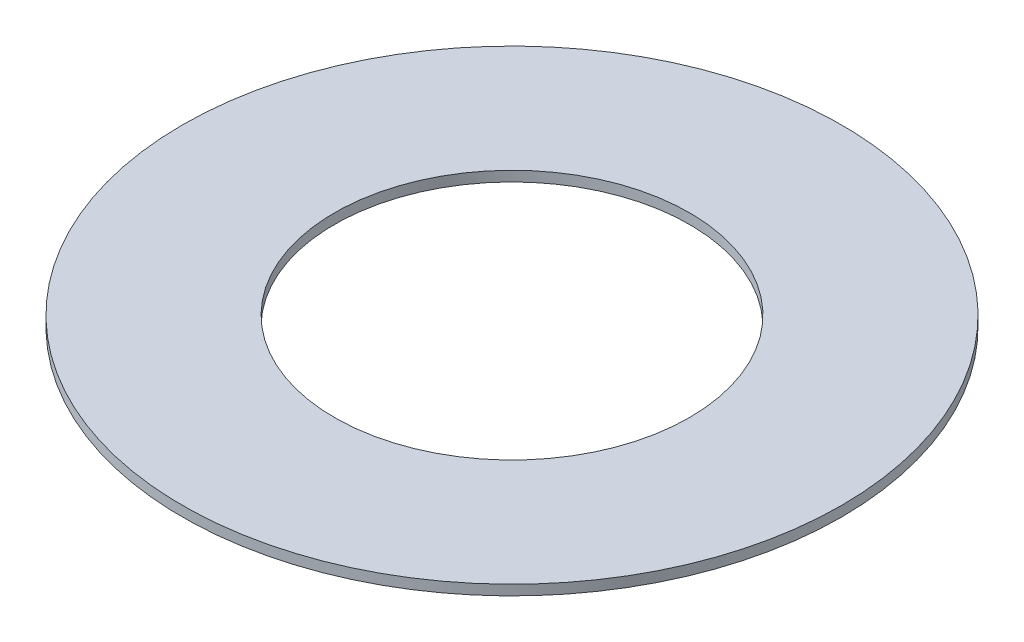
ISO-10303-21;
HEADER;
FILE_DESCRIPTION(('STEP AP214'),'2;1');
FILE_NAME('part.step','',(''),(''),'','','');
FILE_SCHEMA(('AUTOMOTIVE_DESIGN { 1 0 10303 214 1 1 1 1 }'));
ENDSEC;
DATA;
#1=APPLICATION_CONTEXT('core data for automotive mechanical design processes');
#2=APPLICATION_PROTOCOL_DEFINITION('international standard','automotive_design',2000,#1);
#3=PRODUCT_CONTEXT('',#1,'mechanical');
#4=PRODUCT('Part','Part','',(#3));
#5=PRODUCT_RELATED_PRODUCT_CATEGORY('part','',(#4));
#6=PRODUCT_DEFINITION_FORMATION('','',#4);
#7=PRODUCT_DEFINITION_CONTEXT('part definition',#1,'design');
#8=PRODUCT_DEFINITION('design','',#6,#7);
#9=PRODUCT_DEFINITION_SHAPE('','',#8);
#10=(LENGTH_UNIT() NAMED_UNIT(*) SI_UNIT(.MILLI.,.METRE.));
#11=(NAMED_UNIT(*) PLANE_ANGLE_UNIT() SI_UNIT($,.RADIAN.));
#12=(NAMED_UNIT(*) SI_UNIT($,.STERADIAN.) SOLID_ANGLE_UNIT());
#13=UNCERTAINTY_MEASURE_WITH_UNIT(LENGTH_MEASURE(1.E-05),#10,'distance_accuracy_value','');
#14=(GEOMETRIC_REPRESENTATION_CONTEXT(3) GLOBAL_UNCERTAINTY_ASSIGNED_CONTEXT((#13)) GLOBAL_UNIT_ASSIGNED_CONTEXT((#10,
#11,#12)) REPRESENTATION_CONTEXT('',''));
#15=CARTESIAN_POINT('',(0.,0.,0.));
#16=DIRECTION('',(0.,0.,1.));
#17=DIRECTION('',(1.,0.,0.));
#18=AXIS2_PLACEMENT_3D('',#15,#16,#17);
#19=CARTESIAN_POINT('',(0.,0.199999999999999,0.));
#20=DIRECTION('',(0.,-1.,0.));
#21=DIRECTION('',(1.,0.,0.));
#22=AXIS2_PLACEMENT_3D('',#19,#20,#21);
#23=PLANE('',#22);
#24=CARTESIAN_POINT('',(0.,0.199999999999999,0.));
#25=DIRECTION('',(0.,-1.,0.));
#26=DIRECTION('',(1.,0.,0.));
#27=AXIS2_PLACEMENT_3D('',#24,#25,#26);
#28=CIRCLE('',#27,6.5);
#29=CARTESIAN_POINT('',(6.5,0.199999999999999,0.));
#30=VERTEX_POINT('',#29);
#31=EDGE_CURVE('E26',#30,#30,#28,.T.);
#32=ORIENTED_EDGE('',*,*,#31,.F.);
#33=EDGE_LOOP('',(#32));
#34=FACE_BOUND('',#33,.T.);
#35=CARTESIAN_POINT('',(0.,0.199999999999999,0.));
#36=DIRECTION('',(0.,-1.,0.));
#37=DIRECTION('',(1.,0.,0.));
#38=AXIS2_PLACEMENT_3D('',#35,#36,#37);
#39=CIRCLE('',#38,3.5);
#40=CARTESIAN_POINT('',(3.5,0.199999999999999,0.));
#41=VERTEX_POINT('',#40);
#42=EDGE_CURVE('E17',#41,#41,#39,.T.);
#43=ORIENTED_EDGE('',*,*,#42,.T.);
#44=EDGE_LOOP('',(#43));
#45=FACE_BOUND('',#44,.T.);
#46=ADVANCED_FACE('F14',(#34,#45),#23,.F.);
#47=CARTESIAN_POINT('',(0.,0.210000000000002,0.));
#48=DIRECTION('',(0.,-1.,0.));
#49=DIRECTION('',(1.,0.,0.));
#50=AXIS2_PLACEMENT_3D('',#47,#48,#49);
#51=CYLINDRICAL_SURFACE('',#50,3.5);
#52=ORIENTED_EDGE('',*,*,#42,.F.);
#53=EDGE_LOOP('',(#52));
#54=FACE_BOUND('',#53,.T.);
#55=CARTESIAN_POINT('',(0.,0.,0.));
#56=DIRECTION('',(0.,-1.,0.));
#57=DIRECTION('',(1.,0.,0.));
#58=AXIS2_PLACEMENT_3D('',#55,#56,#57);
#59=CIRCLE('',#58,3.5);
#60=CARTESIAN_POINT('',(3.5,0.,0.));
#61=VERTEX_POINT('',#60);
#62=EDGE_CURVE('E21',#61,#61,#59,.F.);
#63=ORIENTED_EDGE('',*,*,#62,.F.);
#64=EDGE_LOOP('',(#63));
#65=FACE_BOUND('',#64,.T.);
#66=ADVANCED_FACE('F35',(#54,#65),#51,.F.);
#67=CARTESIAN_POINT('',(0.,0.210000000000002,0.));
#68=DIRECTION('',(0.,-1.,0.));
#69=DIRECTION('',(1.,0.,0.));
#70=AXIS2_PLACEMENT_3D('',#67,#68,#69);
#71=CYLINDRICAL_SURFACE('',#70,6.5);
#72=ORIENTED_EDGE('',*,*,#31,.T.);
#73=EDGE_LOOP('',(#72));
#74=FACE_BOUND('',#73,.T.);
#75=CARTESIAN_POINT('',(0.,0.,0.));
#76=DIRECTION('',(0.,-1.,0.));
#77=DIRECTION('',(1.,0.,0.));
#78=AXIS2_PLACEMENT_3D('',#75,#76,#77);
#79=CIRCLE('',#78,6.5);
#80=CARTESIAN_POINT('',(6.5,0.,0.));
#81=VERTEX_POINT('',#80);
#82=EDGE_CURVE('E10',#81,#81,#79,.T.);
#83=ORIENTED_EDGE('',*,*,#82,.F.);
#84=EDGE_LOOP('',(#83));
#85=FACE_BOUND('',#84,.T.);
#86=ADVANCED_FACE('F38',(#74,#85),#71,.T.);
#87=CARTESIAN_POINT('',(0.,0.,0.));
#88=DIRECTION('',(0.,-1.,0.));
#89=DIRECTION('',(1.,0.,0.));
#90=AXIS2_PLACEMENT_3D('',#87,#88,#89);
#91=PLANE('',#90);
#92=ORIENTED_EDGE('',*,*,#82,.T.);
#93=EDGE_LOOP('',(#92));
#94=FACE_BOUND('',#93,.T.);
#95=ORIENTED_EDGE('',*,*,#62,.T.);
#96=EDGE_LOOP('',(#95));
#97=FACE_BOUND('',#96,.T.);
#98=ADVANCED_FACE('F41',(#94,#97),#91,.T.);
#99=CLOSED_SHELL('',(#46,#66,#86,#98));
#100=MANIFOLD_SOLID_BREP('B1',#99);
#101=ADVANCED_BREP_SHAPE_REPRESENTATION('',(#18,#100),#14);
#102=SHAPE_DEFINITION_REPRESENTATION(#9,#101);
ENDSEC;
END-ISO-10303-21;
